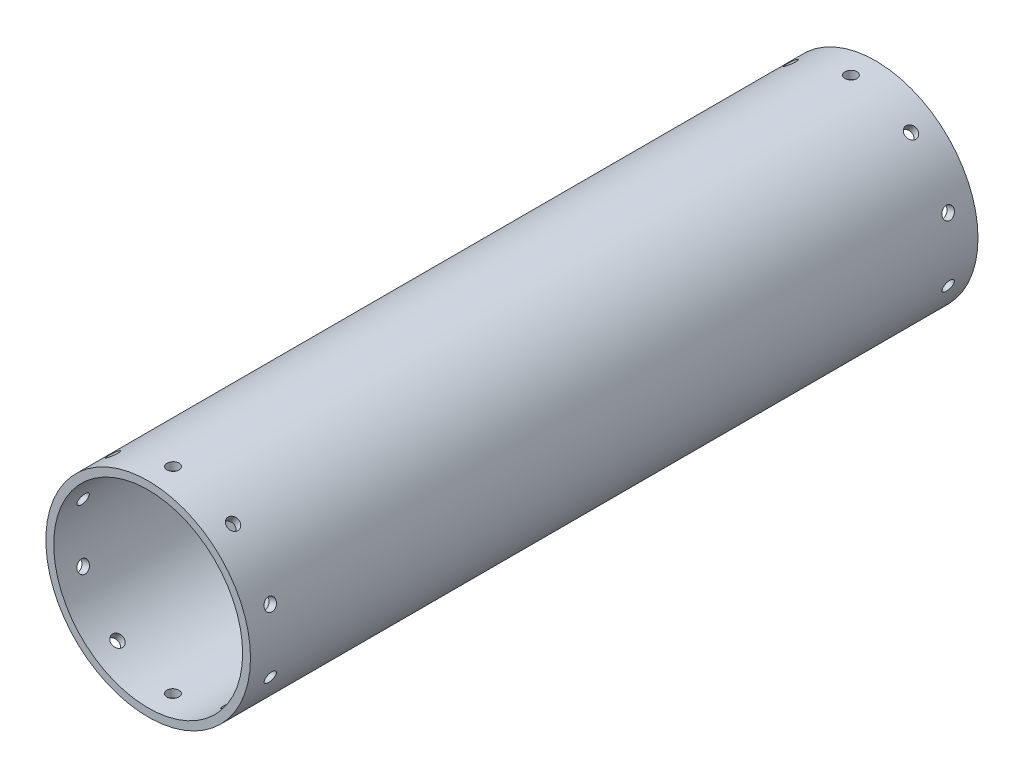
from build123d import *

# Parameters (mm, degrees)
SKETCH1_R               = 41.275
SKETCH1_R_2             = 38.1
BOSS_EXTRUDE2_DEPTH     = 293.4445236
CUT_EXTRUDE1_REACH      = 309.616
CUT_EXTRUDE1_END_RADIUS = 38.1
SKETCH4_R               = 2.413
CIRPATTERN1_COUNT       = 10
CUT_EXTRUDE2_REACH      = 309.616
CUT_EXTRUDE2_END_RADIUS = 38.1
SKETCH5_R               = 2.413
CIRPATTERN2_COUNT       = 10


with BuildPart() as part:
    # Sketch1 → Boss-Extrude2 (new body)
    with BuildSketch(Plane.XY):
        Circle(SKETCH1_R)
        Circle(SKETCH1_R_2, mode=Mode.SUBTRACT)
    extrude(amount=BOSS_EXTRUDE2_DEPTH)

    # Cut-Extrude1: up to this cylinder (the profile starts outside it)
    cut_extrude1_end = Plane(origin=(0, 0, 10.000005), z_dir=(0, 0, -1)) * Cylinder(CUT_EXTRUDE1_END_RADIUS, 696.432, mode=Mode.PRIVATE)
    # Sketch4 → Cut-Extrude1 (cut, up to the surface)
    with BuildSketch(Plane(origin=(0, 41.275, 0), x_dir=(1, 0, 0), z_dir=(0, 1, 0)), mode=Mode.PRIVATE) as cut_extrude1_sk1:
        with Locations(Location((0, -10.0000054, 0), (0, 0, 270))):
            Circle(SKETCH4_R)
    cut_extrude1_tool1 = extrude(cut_extrude1_sk1.sketch, amount=-CUT_EXTRUDE1_REACH, mode=Mode.PRIVATE) - cut_extrude1_end
    cut_extrude1 = cut_extrude1_tool1.solids().sort_by_distance((0, 41.275, 10.000005))[0]
    add(cut_extrude1, mode=Mode.SUBTRACT)

    # CirPattern1: Cut-Extrude1 ×10 about axis
    cirpattern1_axis = Axis((0, 0, 293.4445236), (0, 0, -1))
    for i in range(1, CIRPATTERN1_COUNT):
        add(cut_extrude1.rotate(cirpattern1_axis, i * 360 / CIRPATTERN1_COUNT), mode=Mode.SUBTRACT)

    # Cut-Extrude2: up to this cylinder (the profile starts outside it)
    cut_extrude2_end = Plane(origin=(0, 0, 283.444518), z_dir=(0, 0, -1)) * Cylinder(CUT_EXTRUDE2_END_RADIUS, 696.432, mode=Mode.PRIVATE)
    # Sketch5 → Cut-Extrude2 (cut, up to the surface)
    with BuildSketch(Plane(origin=(0, 41.275, 0), x_dir=(1, 0, 0), z_dir=(0, 1, 0)), mode=Mode.PRIVATE) as cut_extrude2_sk1:
        with Locations(Location((0, -283.4445182, 0), (0, 0, 270))):
            Circle(SKETCH5_R)
    cut_extrude2_tool1 = extrude(cut_extrude2_sk1.sketch, amount=-CUT_EXTRUDE2_REACH, mode=Mode.PRIVATE) - cut_extrude2_end
    cut_extrude2 = cut_extrude2_tool1.solids().sort_by_distance((0, 41.275, 283.444518))[0]
    add(cut_extrude2, mode=Mode.SUBTRACT)

    # CirPattern2: Cut-Extrude2 ×10 about axis
    cirpattern2_axis = Axis((0, 0, 293.4445236), (0, 0, -1))
    for i in range(1, CIRPATTERN2_COUNT):
        add(cut_extrude2.rotate(cirpattern2_axis, i * 360 / CIRPATTERN2_COUNT), mode=Mode.SUBTRACT)


solid = part.part
